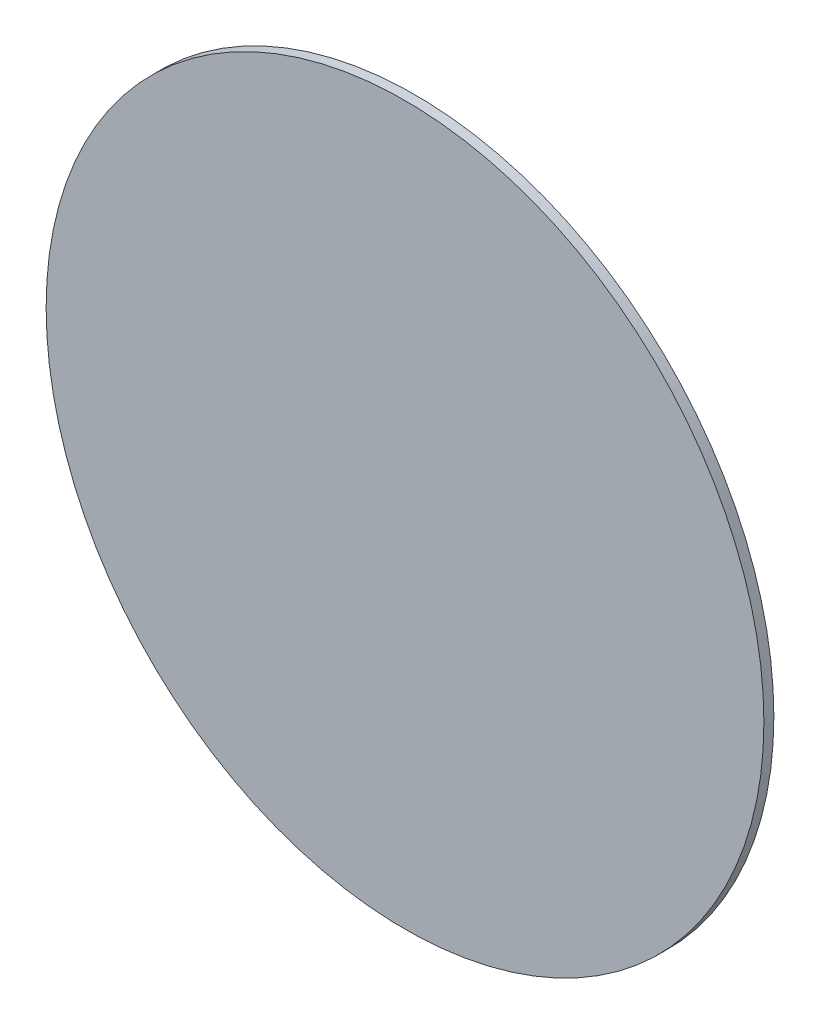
ISO-10303-21;
HEADER;
FILE_DESCRIPTION(('STEP AP214'),'2;1');
FILE_NAME('part.step','',(''),(''),'','','');
FILE_SCHEMA(('AUTOMOTIVE_DESIGN { 1 0 10303 214 1 1 1 1 }'));
ENDSEC;
DATA;
#1=APPLICATION_CONTEXT('core data for automotive mechanical design processes');
#2=APPLICATION_PROTOCOL_DEFINITION('international standard','automotive_design',2000,#1);
#3=PRODUCT_CONTEXT('',#1,'mechanical');
#4=PRODUCT('Part','Part','',(#3));
#5=PRODUCT_RELATED_PRODUCT_CATEGORY('part','',(#4));
#6=PRODUCT_DEFINITION_FORMATION('','',#4);
#7=PRODUCT_DEFINITION_CONTEXT('part definition',#1,'design');
#8=PRODUCT_DEFINITION('design','',#6,#7);
#9=PRODUCT_DEFINITION_SHAPE('','',#8);
#10=(LENGTH_UNIT() NAMED_UNIT(*) SI_UNIT(.MILLI.,.METRE.));
#11=(NAMED_UNIT(*) PLANE_ANGLE_UNIT() SI_UNIT($,.RADIAN.));
#12=(NAMED_UNIT(*) SI_UNIT($,.STERADIAN.) SOLID_ANGLE_UNIT());
#13=UNCERTAINTY_MEASURE_WITH_UNIT(LENGTH_MEASURE(1.E-05),#10,'distance_accuracy_value','');
#14=(GEOMETRIC_REPRESENTATION_CONTEXT(3) GLOBAL_UNCERTAINTY_ASSIGNED_CONTEXT((#13)) GLOBAL_UNIT_ASSIGNED_CONTEXT((#10,
#11,#12)) REPRESENTATION_CONTEXT('',''));
#15=CARTESIAN_POINT('',(0.,0.,0.));
#16=DIRECTION('',(0.,0.,1.));
#17=DIRECTION('',(1.,0.,0.));
#18=AXIS2_PLACEMENT_3D('',#15,#16,#17);
#19=CARTESIAN_POINT('',(0.,39.1553072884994,2.5));
#20=DIRECTION('',(0.,0.,-1.));
#21=DIRECTION('',(-1.,0.,0.));
#22=AXIS2_PLACEMENT_3D('',#19,#20,#21);
#23=CYLINDRICAL_SURFACE('',#22,90.);
#24=CARTESIAN_POINT('',(0.,39.1553072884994,2.5));
#25=DIRECTION('',(0.,0.,1.));
#26=DIRECTION('',(1.,0.,0.));
#27=AXIS2_PLACEMENT_3D('',#24,#25,#26);
#28=CIRCLE('',#27,90.);
#29=CARTESIAN_POINT('',(90.,39.1553072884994,2.5));
#30=VERTEX_POINT('',#29);
#31=EDGE_CURVE('E10',#30,#30,#28,.T.);
#32=ORIENTED_EDGE('',*,*,#31,.F.);
#33=EDGE_LOOP('',(#32));
#34=FACE_BOUND('',#33,.T.);
#35=CARTESIAN_POINT('',(0.,39.1553072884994,0.));
#36=DIRECTION('',(0.,0.,1.));
#37=DIRECTION('',(1.,0.,0.));
#38=AXIS2_PLACEMENT_3D('',#35,#36,#37);
#39=CIRCLE('',#38,90.);
#40=CARTESIAN_POINT('',(90.,39.1553072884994,0.));
#41=VERTEX_POINT('',#40);
#42=EDGE_CURVE('E37',#41,#41,#39,.T.);
#43=ORIENTED_EDGE('',*,*,#42,.T.);
#44=EDGE_LOOP('',(#43));
#45=FACE_BOUND('',#44,.T.);
#46=ADVANCED_FACE('F34',(#34,#45),#23,.T.);
#47=CARTESIAN_POINT('',(0.,39.1553072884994,2.5));
#48=DIRECTION('',(0.,0.,1.));
#49=DIRECTION('',(1.,0.,0.));
#50=AXIS2_PLACEMENT_3D('',#47,#48,#49);
#51=PLANE('',#50);
#52=ORIENTED_EDGE('',*,*,#31,.T.);
#53=EDGE_LOOP('',(#52));
#54=FACE_BOUND('',#53,.T.);
#55=ADVANCED_FACE('F49',(#54),#51,.T.);
#56=CARTESIAN_POINT('',(0.,39.1553072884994,0.));
#57=DIRECTION('',(0.,0.,1.));
#58=DIRECTION('',(1.,0.,0.));
#59=AXIS2_PLACEMENT_3D('',#56,#57,#58);
#60=PLANE('',#59);
#61=ORIENTED_EDGE('',*,*,#42,.F.);
#62=EDGE_LOOP('',(#61));
#63=FACE_BOUND('',#62,.T.);
#64=ADVANCED_FACE('F47',(#63),#60,.F.);
#65=CLOSED_SHELL('',(#46,#55,#64));
#66=MANIFOLD_SOLID_BREP('B2',#65);
#67=ADVANCED_BREP_SHAPE_REPRESENTATION('',(#18,#66),#14);
#68=SHAPE_DEFINITION_REPRESENTATION(#9,#67);
ENDSEC;
END-ISO-10303-21;
